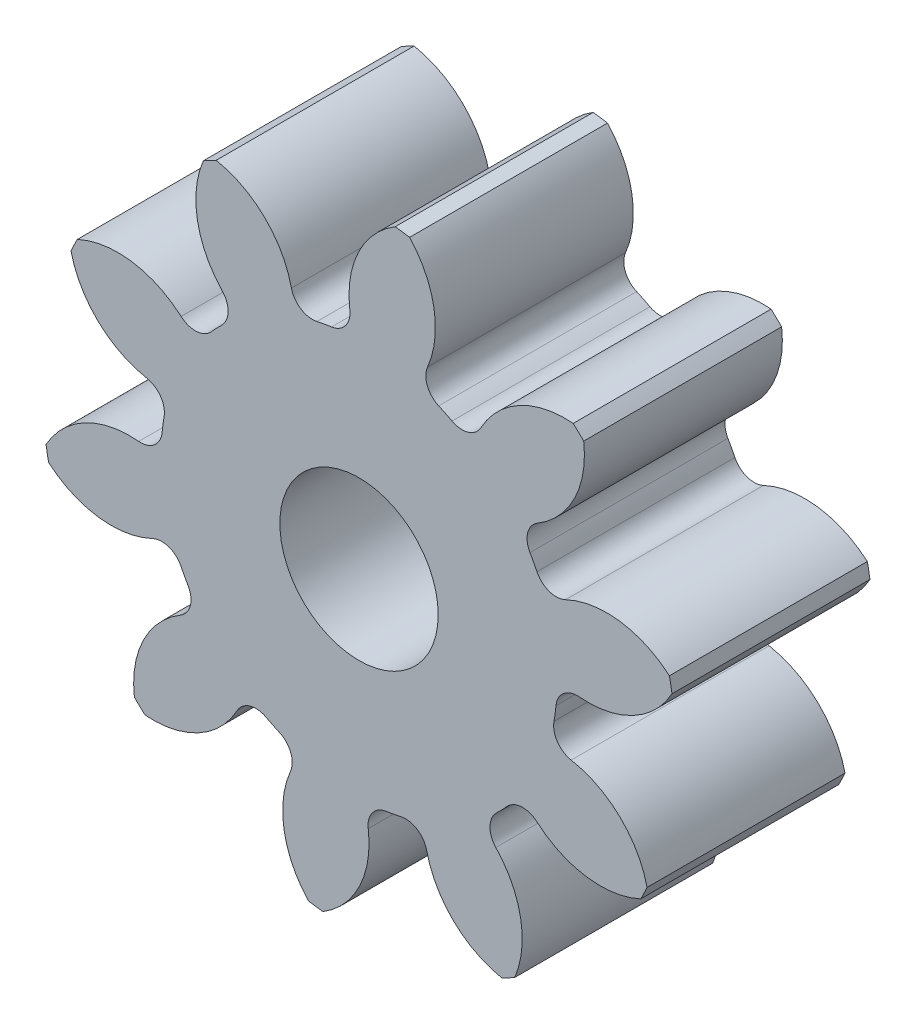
from build123d import *

# Parameters (mm, degrees)
SKETCH3_R         = 203.2
GEARBODY_DEPTH    = 127
TOOTHCUT_DEPTH    = 315.180648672
CIRPATTERN1_COUNT = 10
BOREDIA_R         = 50.8
BORE_DEPTH        = 12700


with BuildPart() as part:
    # Sketch3 → gearBody (new body)
    with BuildSketch(Plane.XY):
        Circle(SKETCH3_R)
    extrude(amount=GEARBODY_DEPTH)

    # Sketch2 → toothCut (cut, through all)
    with BuildSketch(Plane.XY):
        with BuildLine():
            ThreePointArc((125.066526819, -22.076319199), (125.804284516, -17.386258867), (126.366225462, -12.671900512))
            ThreePointArc((126.366225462, -12.671900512), (131.314385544, -3.410742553), (141.349976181, -0.322012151))
            ThreePointArc((141.349976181, -0.322012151), (178.111858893, 7.865571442), (203.2, 35.955742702))
            ThreePointArc((203.2, 35.955742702), (204.413757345, -28.250154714), (185.831474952, -89.72022264))
            ThreePointArc((185.831474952, -89.72022264), (169.302372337, -55.878512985), (136.139085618, -38.027211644))
            ThreePointArc((136.139085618, -38.027211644), (127.317389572, -32.332388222), (125.066526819, -22.076319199))
        make_face()
    toothcut = extrude(amount=TOOTHCUT_DEPTH, mode=Mode.SUBTRACT)

    # CirPattern1: toothCut ×10 about axis
    cirpattern1_axis = Axis((0, 0, 0), (0, 0, 1))
    for i in range(1, CIRPATTERN1_COUNT):
        add(toothcut.rotate(cirpattern1_axis, i * 360 / CIRPATTERN1_COUNT), mode=Mode.SUBTRACT)

    # boreDia → bore (cut, symmetric)
    with BuildSketch(Plane.XY):
        Circle(BOREDIA_R)
    extrude(amount=BORE_DEPTH, both=True, mode=Mode.SUBTRACT)


solid = part.part
